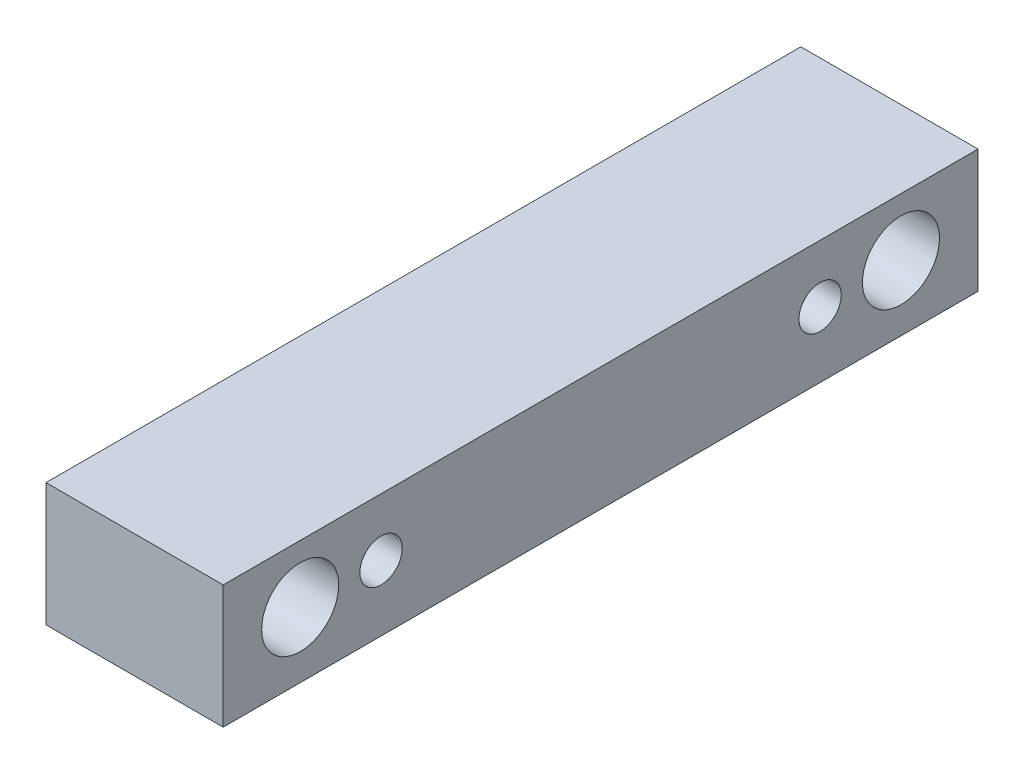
ISO-10303-21;
HEADER;
FILE_DESCRIPTION(('STEP AP214'),'2;1');
FILE_NAME('part.step','',(''),(''),'','','');
FILE_SCHEMA(('AUTOMOTIVE_DESIGN { 1 0 10303 214 1 1 1 1 }'));
ENDSEC;
DATA;
#1=APPLICATION_CONTEXT('core data for automotive mechanical design processes');
#2=APPLICATION_PROTOCOL_DEFINITION('international standard','automotive_design',2000,#1);
#3=PRODUCT_CONTEXT('',#1,'mechanical');
#4=PRODUCT('Part','Part','',(#3));
#5=PRODUCT_RELATED_PRODUCT_CATEGORY('part','',(#4));
#6=PRODUCT_DEFINITION_FORMATION('','',#4);
#7=PRODUCT_DEFINITION_CONTEXT('part definition',#1,'design');
#8=PRODUCT_DEFINITION('design','',#6,#7);
#9=PRODUCT_DEFINITION_SHAPE('','',#8);
#10=(LENGTH_UNIT() NAMED_UNIT(*) SI_UNIT(.MILLI.,.METRE.));
#11=(NAMED_UNIT(*) PLANE_ANGLE_UNIT() SI_UNIT($,.RADIAN.));
#12=(NAMED_UNIT(*) SI_UNIT($,.STERADIAN.) SOLID_ANGLE_UNIT());
#13=UNCERTAINTY_MEASURE_WITH_UNIT(LENGTH_MEASURE(1.E-05),#10,'distance_accuracy_value','');
#14=(GEOMETRIC_REPRESENTATION_CONTEXT(3) GLOBAL_UNCERTAINTY_ASSIGNED_CONTEXT((#13)) GLOBAL_UNIT_ASSIGNED_CONTEXT((#10,
#11,#12)) REPRESENTATION_CONTEXT('',''));
#15=CARTESIAN_POINT('',(0.,0.,0.));
#16=DIRECTION('',(0.,0.,1.));
#17=DIRECTION('',(1.,0.,0.));
#18=AXIS2_PLACEMENT_3D('',#15,#16,#17);
#19=CARTESIAN_POINT('',(-148.,16.,98.0000000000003));
#20=DIRECTION('',(-1.,0.,0.));
#21=DIRECTION('',(0.,0.,1.));
#22=AXIS2_PLACEMENT_3D('',#19,#20,#21);
#23=PLANE('',#22);
#24=CARTESIAN_POINT('',(-148.,17.,41.));
#25=DIRECTION('',(-1.,0.,0.));
#26=DIRECTION('',(0.,0.,1.));
#27=AXIS2_PLACEMENT_3D('',#24,#25,#26);
#28=CIRCLE('',#27,5.5);
#29=CARTESIAN_POINT('',(-148.,17.,46.5000000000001));
#30=VERTEX_POINT('',#29);
#31=EDGE_CURVE('E102',#30,#30,#28,.T.);
#32=ORIENTED_EDGE('',*,*,#31,.F.);
#33=EDGE_LOOP('',(#32));
#34=FACE_BOUND('',#33,.T.);
#35=CARTESIAN_POINT('',(-148.,17.,155.));
#36=DIRECTION('',(-1.,0.,0.));
#37=DIRECTION('',(0.,0.,1.));
#38=AXIS2_PLACEMENT_3D('',#35,#36,#37);
#39=CIRCLE('',#38,5.5);
#40=CARTESIAN_POINT('',(-148.,17.,160.5));
#41=VERTEX_POINT('',#40);
#42=EDGE_CURVE('E99',#41,#41,#39,.T.);
#43=ORIENTED_EDGE('',*,*,#42,.F.);
#44=EDGE_LOOP('',(#43));
#45=FACE_BOUND('',#44,.T.);
#46=CARTESIAN_POINT('',(-148.,17.0000000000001,176.));
#47=DIRECTION('',(-1.,0.,0.));
#48=DIRECTION('',(0.,0.,1.));
#49=AXIS2_PLACEMENT_3D('',#46,#47,#48);
#50=CIRCLE('',#49,10.);
#51=CARTESIAN_POINT('',(-148.,17.0000000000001,186.));
#52=VERTEX_POINT('',#51);
#53=EDGE_CURVE('E96',#52,#52,#50,.T.);
#54=ORIENTED_EDGE('',*,*,#53,.F.);
#55=EDGE_LOOP('',(#54));
#56=FACE_BOUND('',#55,.T.);
#57=CARTESIAN_POINT('',(-148.,17.,20.));
#58=DIRECTION('',(-1.,0.,0.));
#59=DIRECTION('',(0.,0.,1.));
#60=AXIS2_PLACEMENT_3D('',#57,#58,#59);
#61=CIRCLE('',#60,10.);
#62=CARTESIAN_POINT('',(-148.,17.,30.));
#63=VERTEX_POINT('',#62);
#64=EDGE_CURVE('E73',#63,#63,#61,.T.);
#65=ORIENTED_EDGE('',*,*,#64,.F.);
#66=EDGE_LOOP('',(#65));
#67=FACE_BOUND('',#66,.T.);
#68=DIRECTION('',(0.,0.,-1.));
#69=VECTOR('',#68,1.);
#70=CARTESIAN_POINT('',(-148.,0.,98.0000000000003));
#71=LINE('',#70,#69);
#72=CARTESIAN_POINT('',(-148.,0.,196.000000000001));
#73=VERTEX_POINT('',#72);
#74=CARTESIAN_POINT('',(-148.,0.,0.));
#75=VERTEX_POINT('',#74);
#76=EDGE_CURVE('E11',#73,#75,#71,.T.);
#77=ORIENTED_EDGE('',*,*,#76,.F.);
#78=DIRECTION('',(0.,-1.,0.));
#79=VECTOR('',#78,1.);
#80=CARTESIAN_POINT('',(-148.,16.0000000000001,196.000000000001));
#81=LINE('',#80,#79);
#82=CARTESIAN_POINT('',(-148.,32.0000000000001,196.000000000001));
#83=VERTEX_POINT('',#82);
#84=EDGE_CURVE('E62',#83,#73,#81,.T.);
#85=ORIENTED_EDGE('',*,*,#84,.F.);
#86=DIRECTION('',(0.,0.,1.));
#87=VECTOR('',#86,1.);
#88=CARTESIAN_POINT('',(-148.,32.0000000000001,98.0000000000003));
#89=LINE('',#88,#87);
#90=CARTESIAN_POINT('',(-148.,32.0000000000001,0.));
#91=VERTEX_POINT('',#90);
#92=EDGE_CURVE('E90',#91,#83,#89,.T.);
#93=ORIENTED_EDGE('',*,*,#92,.F.);
#94=DIRECTION('',(0.,1.,0.));
#95=VECTOR('',#94,1.);
#96=CARTESIAN_POINT('',(-148.,16.,0.));
#97=LINE('',#96,#95);
#98=EDGE_CURVE('E24',#75,#91,#97,.T.);
#99=ORIENTED_EDGE('',*,*,#98,.F.);
#100=EDGE_LOOP('',(#77,#85,#93,#99));
#101=FACE_BOUND('',#100,.T.);
#102=ADVANCED_FACE('F16',(#34,#45,#56,#67,#101),#23,.T.);
#103=CARTESIAN_POINT('',(-102.,0.,98.0000000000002));
#104=DIRECTION('',(0.,-1.,0.));
#105=DIRECTION('',(1.,0.,0.));
#106=AXIS2_PLACEMENT_3D('',#103,#104,#105);
#107=PLANE('',#106);
#108=DIRECTION('',(-1.,0.,0.));
#109=VECTOR('',#108,1.);
#110=CARTESIAN_POINT('',(-102.,0.,196.000000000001));
#111=LINE('',#110,#109);
#112=CARTESIAN_POINT('',(-102.,0.,196.000000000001));
#113=VERTEX_POINT('',#112);
#114=EDGE_CURVE('E55',#113,#73,#111,.T.);
#115=ORIENTED_EDGE('',*,*,#114,.T.);
#116=ORIENTED_EDGE('',*,*,#76,.T.);
#117=DIRECTION('',(-1.,0.,0.));
#118=VECTOR('',#117,1.);
#119=CARTESIAN_POINT('',(-102.,0.,0.));
#120=LINE('',#119,#118);
#121=CARTESIAN_POINT('',(-102.,0.,0.));
#122=VERTEX_POINT('',#121);
#123=EDGE_CURVE('E68',#122,#75,#120,.T.);
#124=ORIENTED_EDGE('',*,*,#123,.F.);
#125=DIRECTION('',(0.,0.,1.));
#126=VECTOR('',#125,1.);
#127=CARTESIAN_POINT('',(-102.,0.,98.0000000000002));
#128=LINE('',#127,#126);
#129=EDGE_CURVE('E66',#122,#113,#128,.T.);
#130=ORIENTED_EDGE('',*,*,#129,.T.);
#131=EDGE_LOOP('',(#115,#116,#124,#130));
#132=FACE_BOUND('',#131,.T.);
#133=ADVANCED_FACE('F67',(#132),#107,.T.);
#134=CARTESIAN_POINT('',(-102.,16.0000000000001,0.));
#135=DIRECTION('',(0.,0.,-1.));
#136=DIRECTION('',(-1.,0.,0.));
#137=AXIS2_PLACEMENT_3D('',#134,#135,#136);
#138=PLANE('',#137);
#139=ORIENTED_EDGE('',*,*,#123,.T.);
#140=ORIENTED_EDGE('',*,*,#98,.T.);
#141=DIRECTION('',(-1.,0.,0.));
#142=VECTOR('',#141,1.);
#143=CARTESIAN_POINT('',(-102.,32.0000000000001,0.));
#144=LINE('',#143,#142);
#145=CARTESIAN_POINT('',(-102.,32.0000000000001,0.));
#146=VERTEX_POINT('',#145);
#147=EDGE_CURVE('E85',#146,#91,#144,.T.);
#148=ORIENTED_EDGE('',*,*,#147,.F.);
#149=DIRECTION('',(0.,-1.,0.));
#150=VECTOR('',#149,1.);
#151=CARTESIAN_POINT('',(-102.,16.0000000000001,0.));
#152=LINE('',#151,#150);
#153=EDGE_CURVE('E72',#146,#122,#152,.T.);
#154=ORIENTED_EDGE('',*,*,#153,.T.);
#155=EDGE_LOOP('',(#139,#140,#148,#154));
#156=FACE_BOUND('',#155,.T.);
#157=ADVANCED_FACE('F123',(#156),#138,.T.);
#158=CARTESIAN_POINT('',(-102.,32.0000000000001,98.0000000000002));
#159=DIRECTION('',(0.,1.,0.));
#160=DIRECTION('',(-1.,0.,0.));
#161=AXIS2_PLACEMENT_3D('',#158,#159,#160);
#162=PLANE('',#161);
#163=ORIENTED_EDGE('',*,*,#147,.T.);
#164=ORIENTED_EDGE('',*,*,#92,.T.);
#165=DIRECTION('',(-1.,0.,0.));
#166=VECTOR('',#165,1.);
#167=CARTESIAN_POINT('',(-102.,32.0000000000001,196.000000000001));
#168=LINE('',#167,#166);
#169=CARTESIAN_POINT('',(-102.,32.0000000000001,196.000000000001));
#170=VERTEX_POINT('',#169);
#171=EDGE_CURVE('E63',#170,#83,#168,.T.);
#172=ORIENTED_EDGE('',*,*,#171,.F.);
#173=DIRECTION('',(0.,0.,-1.));
#174=VECTOR('',#173,1.);
#175=CARTESIAN_POINT('',(-102.,32.0000000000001,98.0000000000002));
#176=LINE('',#175,#174);
#177=EDGE_CURVE('E78',#170,#146,#176,.T.);
#178=ORIENTED_EDGE('',*,*,#177,.T.);
#179=EDGE_LOOP('',(#163,#164,#172,#178));
#180=FACE_BOUND('',#179,.T.);
#181=ADVANCED_FACE('F125',(#180),#162,.T.);
#182=CARTESIAN_POINT('',(-102.,16.0000000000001,98.0000000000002));
#183=DIRECTION('',(1.,0.,0.));
#184=DIRECTION('',(0.,0.,-1.));
#185=AXIS2_PLACEMENT_3D('',#182,#183,#184);
#186=PLANE('',#185);
#187=CARTESIAN_POINT('',(-102.,17.0000000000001,41.));
#188=DIRECTION('',(1.,0.,0.));
#189=DIRECTION('',(0.,0.,-1.));
#190=AXIS2_PLACEMENT_3D('',#187,#188,#189);
#191=CIRCLE('',#190,5.5);
#192=CARTESIAN_POINT('',(-102.,17.0000000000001,35.5));
#193=VERTEX_POINT('',#192);
#194=EDGE_CURVE('E19',#193,#193,#191,.T.);
#195=ORIENTED_EDGE('',*,*,#194,.F.);
#196=EDGE_LOOP('',(#195));
#197=FACE_BOUND('',#196,.T.);
#198=CARTESIAN_POINT('',(-102.,17.0000000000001,155.));
#199=DIRECTION('',(1.,0.,0.));
#200=DIRECTION('',(0.,0.,-1.));
#201=AXIS2_PLACEMENT_3D('',#198,#199,#200);
#202=CIRCLE('',#201,5.5);
#203=CARTESIAN_POINT('',(-102.,17.0000000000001,149.5));
#204=VERTEX_POINT('',#203);
#205=EDGE_CURVE('E100',#204,#204,#202,.T.);
#206=ORIENTED_EDGE('',*,*,#205,.F.);
#207=EDGE_LOOP('',(#206));
#208=FACE_BOUND('',#207,.T.);
#209=CARTESIAN_POINT('',(-102.,17.0000000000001,176.));
#210=DIRECTION('',(1.,0.,0.));
#211=DIRECTION('',(0.,0.,-1.));
#212=AXIS2_PLACEMENT_3D('',#209,#210,#211);
#213=CIRCLE('',#212,10.);
#214=CARTESIAN_POINT('',(-102.,17.0000000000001,166.));
#215=VERTEX_POINT('',#214);
#216=EDGE_CURVE('E97',#215,#215,#213,.T.);
#217=ORIENTED_EDGE('',*,*,#216,.F.);
#218=EDGE_LOOP('',(#217));
#219=FACE_BOUND('',#218,.T.);
#220=CARTESIAN_POINT('',(-102.,17.0000000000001,20.));
#221=DIRECTION('',(1.,0.,0.));
#222=DIRECTION('',(0.,0.,-1.));
#223=AXIS2_PLACEMENT_3D('',#220,#221,#222);
#224=CIRCLE('',#223,10.);
#225=CARTESIAN_POINT('',(-102.,17.0000000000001,10.));
#226=VERTEX_POINT('',#225);
#227=EDGE_CURVE('E93',#226,#226,#224,.T.);
#228=ORIENTED_EDGE('',*,*,#227,.F.);
#229=EDGE_LOOP('',(#228));
#230=FACE_BOUND('',#229,.T.);
#231=DIRECTION('',(0.,1.,0.));
#232=VECTOR('',#231,1.);
#233=CARTESIAN_POINT('',(-102.,16.0000000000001,196.000000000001));
#234=LINE('',#233,#232);
#235=EDGE_CURVE('E60',#113,#170,#234,.T.);
#236=ORIENTED_EDGE('',*,*,#235,.F.);
#237=ORIENTED_EDGE('',*,*,#129,.F.);
#238=ORIENTED_EDGE('',*,*,#153,.F.);
#239=ORIENTED_EDGE('',*,*,#177,.F.);
#240=EDGE_LOOP('',(#236,#237,#238,#239));
#241=FACE_BOUND('',#240,.T.);
#242=ADVANCED_FACE('F76',(#197,#208,#219,#230,#241),#186,.T.);
#243=CARTESIAN_POINT('',(-102.,16.0000000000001,196.000000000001));
#244=DIRECTION('',(0.,0.,1.));
#245=DIRECTION('',(1.,0.,0.));
#246=AXIS2_PLACEMENT_3D('',#243,#244,#245);
#247=PLANE('',#246);
#248=ORIENTED_EDGE('',*,*,#235,.T.);
#249=ORIENTED_EDGE('',*,*,#171,.T.);
#250=ORIENTED_EDGE('',*,*,#84,.T.);
#251=ORIENTED_EDGE('',*,*,#114,.F.);
#252=EDGE_LOOP('',(#248,#249,#250,#251));
#253=FACE_BOUND('',#252,.T.);
#254=ADVANCED_FACE('F57',(#253),#247,.T.);
#255=CARTESIAN_POINT('',(3.,17.,20.));
#256=DIRECTION('',(-1.,0.,0.));
#257=DIRECTION('',(0.,1.,0.));
#258=AXIS2_PLACEMENT_3D('',#255,#256,#257);
#259=CYLINDRICAL_SURFACE('',#258,10.);
#260=ORIENTED_EDGE('',*,*,#64,.T.);
#261=EDGE_LOOP('',(#260));
#262=FACE_BOUND('',#261,.T.);
#263=ORIENTED_EDGE('',*,*,#227,.T.);
#264=EDGE_LOOP('',(#263));
#265=FACE_BOUND('',#264,.T.);
#266=ADVANCED_FACE('F117',(#262,#265),#259,.F.);
#267=CARTESIAN_POINT('',(3.00000000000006,17.0000000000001,176.));
#268=DIRECTION('',(-1.,0.,0.));
#269=DIRECTION('',(0.,1.,0.));
#270=AXIS2_PLACEMENT_3D('',#267,#268,#269);
#271=CYLINDRICAL_SURFACE('',#270,10.);
#272=ORIENTED_EDGE('',*,*,#53,.T.);
#273=EDGE_LOOP('',(#272));
#274=FACE_BOUND('',#273,.T.);
#275=ORIENTED_EDGE('',*,*,#216,.T.);
#276=EDGE_LOOP('',(#275));
#277=FACE_BOUND('',#276,.T.);
#278=ADVANCED_FACE('F151',(#274,#277),#271,.F.);
#279=CARTESIAN_POINT('',(-149.,17.,155.));
#280=DIRECTION('',(1.,0.,0.));
#281=DIRECTION('',(0.,-1.,0.));
#282=AXIS2_PLACEMENT_3D('',#279,#280,#281);
#283=CYLINDRICAL_SURFACE('',#282,5.5);
#284=ORIENTED_EDGE('',*,*,#42,.T.);
#285=EDGE_LOOP('',(#284));
#286=FACE_BOUND('',#285,.T.);
#287=ORIENTED_EDGE('',*,*,#205,.T.);
#288=EDGE_LOOP('',(#287));
#289=FACE_BOUND('',#288,.T.);
#290=ADVANCED_FACE('F156',(#286,#289),#283,.F.);
#291=CARTESIAN_POINT('',(-149.,17.,41.));
#292=DIRECTION('',(1.,0.,0.));
#293=DIRECTION('',(0.,-1.,0.));
#294=AXIS2_PLACEMENT_3D('',#291,#292,#293);
#295=CYLINDRICAL_SURFACE('',#294,5.5);
#296=ORIENTED_EDGE('',*,*,#31,.T.);
#297=EDGE_LOOP('',(#296));
#298=FACE_BOUND('',#297,.T.);
#299=ORIENTED_EDGE('',*,*,#194,.T.);
#300=EDGE_LOOP('',(#299));
#301=FACE_BOUND('',#300,.T.);
#302=ADVANCED_FACE('F162',(#298,#301),#295,.F.);
#303=CLOSED_SHELL('',(#102,#133,#157,#181,#242,#254,#266,#278,#290,#302));
#304=MANIFOLD_SOLID_BREP('B1',#303);
#305=ADVANCED_BREP_SHAPE_REPRESENTATION('',(#18,#304),#14);
#306=SHAPE_DEFINITION_REPRESENTATION(#9,#305);
ENDSEC;
END-ISO-10303-21;
